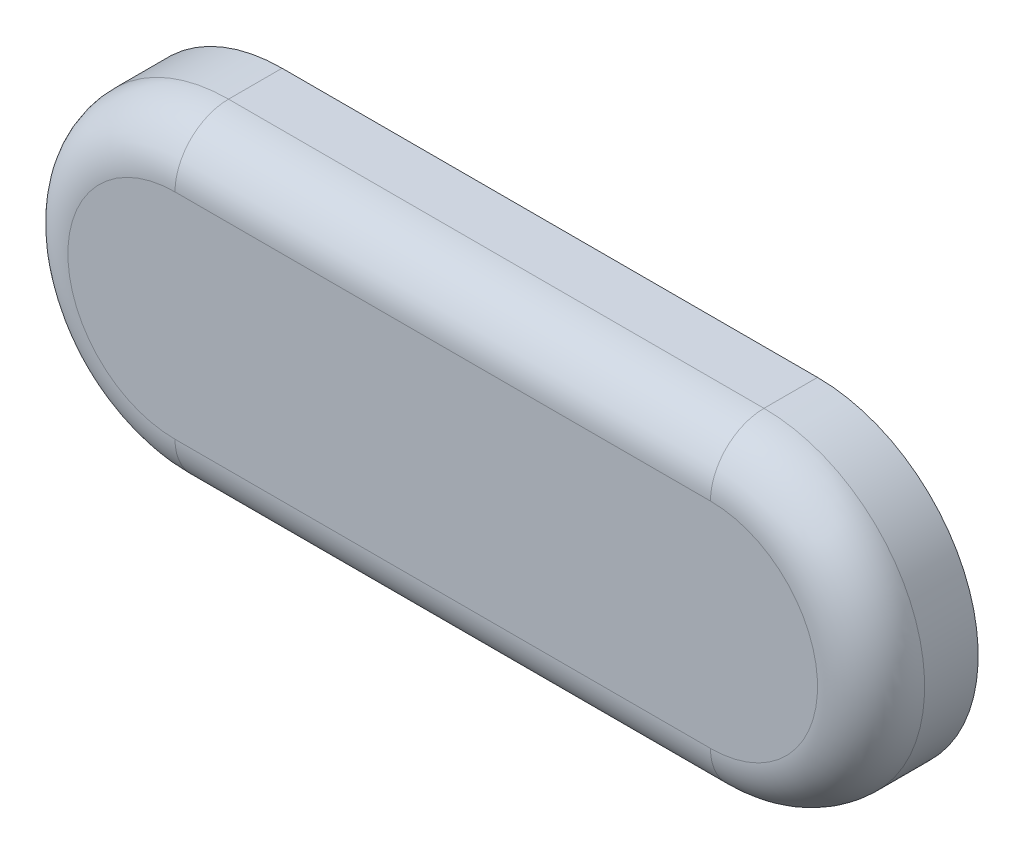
ISO-10303-21;
HEADER;
FILE_DESCRIPTION(('STEP AP214'),'2;1');
FILE_NAME('part.step','',(''),(''),'','','');
FILE_SCHEMA(('AUTOMOTIVE_DESIGN { 1 0 10303 214 1 1 1 1 }'));
ENDSEC;
DATA;
#1=APPLICATION_CONTEXT('core data for automotive mechanical design processes');
#2=APPLICATION_PROTOCOL_DEFINITION('international standard','automotive_design',2000,#1);
#3=PRODUCT_CONTEXT('',#1,'mechanical');
#4=PRODUCT('Part','Part','',(#3));
#5=PRODUCT_RELATED_PRODUCT_CATEGORY('part','',(#4));
#6=PRODUCT_DEFINITION_FORMATION('','',#4);
#7=PRODUCT_DEFINITION_CONTEXT('part definition',#1,'design');
#8=PRODUCT_DEFINITION('design','',#6,#7);
#9=PRODUCT_DEFINITION_SHAPE('','',#8);
#10=(LENGTH_UNIT() NAMED_UNIT(*) SI_UNIT(.MILLI.,.METRE.));
#11=(NAMED_UNIT(*) PLANE_ANGLE_UNIT() SI_UNIT($,.RADIAN.));
#12=(NAMED_UNIT(*) SI_UNIT($,.STERADIAN.) SOLID_ANGLE_UNIT());
#13=UNCERTAINTY_MEASURE_WITH_UNIT(LENGTH_MEASURE(1.E-05),#10,'distance_accuracy_value','');
#14=(GEOMETRIC_REPRESENTATION_CONTEXT(3) GLOBAL_UNCERTAINTY_ASSIGNED_CONTEXT((#13)) GLOBAL_UNIT_ASSIGNED_CONTEXT((#10,
#11,#12)) REPRESENTATION_CONTEXT('',''));
#15=CARTESIAN_POINT('',(0.,0.,0.));
#16=DIRECTION('',(0.,0.,1.));
#17=DIRECTION('',(1.,0.,0.));
#18=AXIS2_PLACEMENT_3D('',#15,#16,#17);
#19=CARTESIAN_POINT('',(-5.,-23.375,2.));
#20=DIRECTION('',(0.,0.,-1.));
#21=DIRECTION('',(-1.,0.,0.));
#22=AXIS2_PLACEMENT_3D('',#19,#20,#21);
#23=CYLINDRICAL_SURFACE('',#22,3.);
#24=DIRECTION('',(0.,0.,-1.));
#25=VECTOR('',#24,1.);
#26=CARTESIAN_POINT('',(-5.,-26.375,2.));
#27=LINE('',#26,#25);
#28=CARTESIAN_POINT('',(-5.,-26.375,1.));
#29=VERTEX_POINT('',#28);
#30=CARTESIAN_POINT('',(-5.,-26.375,0.));
#31=VERTEX_POINT('',#30);
#32=EDGE_CURVE('E91',#29,#31,#27,.T.);
#33=ORIENTED_EDGE('',*,*,#32,.F.);
#34=CARTESIAN_POINT('',(-5.,-23.375,1.));
#35=DIRECTION('',(0.,0.,1.));
#36=DIRECTION('',(1.,0.,0.));
#37=AXIS2_PLACEMENT_3D('',#34,#35,#36);
#38=CIRCLE('',#37,3.);
#39=CARTESIAN_POINT('',(-5.,-20.375,1.));
#40=VERTEX_POINT('',#39);
#41=EDGE_CURVE('E61',#29,#40,#38,.F.);
#42=ORIENTED_EDGE('',*,*,#41,.T.);
#43=DIRECTION('',(0.,0.,-1.));
#44=VECTOR('',#43,1.);
#45=CARTESIAN_POINT('',(-5.,-20.375,2.));
#46=LINE('',#45,#44);
#47=CARTESIAN_POINT('',(-5.,-20.375,0.));
#48=VERTEX_POINT('',#47);
#49=EDGE_CURVE('E111',#40,#48,#46,.T.);
#50=ORIENTED_EDGE('',*,*,#49,.T.);
#51=CARTESIAN_POINT('',(-5.,-23.375,0.));
#52=DIRECTION('',(0.,0.,1.));
#53=DIRECTION('',(1.,0.,0.));
#54=AXIS2_PLACEMENT_3D('',#51,#52,#53);
#55=CIRCLE('',#54,3.);
#56=EDGE_CURVE('E107',#48,#31,#55,.T.);
#57=ORIENTED_EDGE('',*,*,#56,.T.);
#58=EDGE_LOOP('',(#33,#42,#50,#57));
#59=FACE_BOUND('',#58,.T.);
#60=ADVANCED_FACE('F37',(#59),#23,.T.);
#61=CARTESIAN_POINT('',(-5.,-26.375,2.));
#62=DIRECTION('',(0.,1.,0.));
#63=DIRECTION('',(0.,0.,1.));
#64=AXIS2_PLACEMENT_3D('',#61,#62,#63);
#65=PLANE('',#64);
#66=DIRECTION('',(0.,0.,-1.));
#67=VECTOR('',#66,1.);
#68=CARTESIAN_POINT('',(5.,-26.375,2.));
#69=LINE('',#68,#67);
#70=CARTESIAN_POINT('',(5.,-26.375,1.));
#71=VERTEX_POINT('',#70);
#72=CARTESIAN_POINT('',(5.,-26.375,0.));
#73=VERTEX_POINT('',#72);
#74=EDGE_CURVE('E101',#71,#73,#69,.T.);
#75=ORIENTED_EDGE('',*,*,#74,.F.);
#76=DIRECTION('',(1.,0.,0.));
#77=VECTOR('',#76,1.);
#78=CARTESIAN_POINT('',(-5.,-26.375,1.));
#79=LINE('',#78,#77);
#80=EDGE_CURVE('E98',#71,#29,#79,.F.);
#81=ORIENTED_EDGE('',*,*,#80,.T.);
#82=ORIENTED_EDGE('',*,*,#32,.T.);
#83=DIRECTION('',(1.,0.,0.));
#84=VECTOR('',#83,1.);
#85=CARTESIAN_POINT('',(-5.,-26.375,0.));
#86=LINE('',#85,#84);
#87=EDGE_CURVE('E95',#31,#73,#86,.T.);
#88=ORIENTED_EDGE('',*,*,#87,.T.);
#89=EDGE_LOOP('',(#75,#81,#82,#88));
#90=FACE_BOUND('',#89,.T.);
#91=ADVANCED_FACE('F94',(#90),#65,.F.);
#92=CARTESIAN_POINT('',(5.,-23.375,2.));
#93=DIRECTION('',(0.,0.,-1.));
#94=DIRECTION('',(-1.,0.,0.));
#95=AXIS2_PLACEMENT_3D('',#92,#93,#94);
#96=CYLINDRICAL_SURFACE('',#95,3.);
#97=DIRECTION('',(0.,0.,-1.));
#98=VECTOR('',#97,1.);
#99=CARTESIAN_POINT('',(5.,-20.375,2.));
#100=LINE('',#99,#98);
#101=CARTESIAN_POINT('',(5.,-20.375,1.));
#102=VERTEX_POINT('',#101);
#103=CARTESIAN_POINT('',(5.,-20.375,0.));
#104=VERTEX_POINT('',#103);
#105=EDGE_CURVE('E121',#102,#104,#100,.T.);
#106=ORIENTED_EDGE('',*,*,#105,.F.);
#107=CARTESIAN_POINT('',(5.,-23.375,1.));
#108=DIRECTION('',(0.,0.,1.));
#109=DIRECTION('',(1.,0.,0.));
#110=AXIS2_PLACEMENT_3D('',#107,#108,#109);
#111=CIRCLE('',#110,3.);
#112=EDGE_CURVE('E11',#102,#71,#111,.F.);
#113=ORIENTED_EDGE('',*,*,#112,.T.);
#114=ORIENTED_EDGE('',*,*,#74,.T.);
#115=CARTESIAN_POINT('',(5.,-23.375,0.));
#116=DIRECTION('',(0.,0.,1.));
#117=DIRECTION('',(1.,0.,0.));
#118=AXIS2_PLACEMENT_3D('',#115,#116,#117);
#119=CIRCLE('',#118,3.);
#120=EDGE_CURVE('E109',#73,#104,#119,.T.);
#121=ORIENTED_EDGE('',*,*,#120,.T.);
#122=EDGE_LOOP('',(#106,#113,#114,#121));
#123=FACE_BOUND('',#122,.T.);
#124=ADVANCED_FACE('F168',(#123),#96,.T.);
#125=CARTESIAN_POINT('',(5.,-20.375,2.));
#126=DIRECTION('',(0.,-1.,0.));
#127=DIRECTION('',(0.,0.,-1.));
#128=AXIS2_PLACEMENT_3D('',#125,#126,#127);
#129=PLANE('',#128);
#130=ORIENTED_EDGE('',*,*,#49,.F.);
#131=DIRECTION('',(-1.,0.,0.));
#132=VECTOR('',#131,1.);
#133=CARTESIAN_POINT('',(5.,-20.375,1.));
#134=LINE('',#133,#132);
#135=EDGE_CURVE('E46',#40,#102,#134,.F.);
#136=ORIENTED_EDGE('',*,*,#135,.T.);
#137=ORIENTED_EDGE('',*,*,#105,.T.);
#138=DIRECTION('',(-1.,0.,0.));
#139=VECTOR('',#138,1.);
#140=CARTESIAN_POINT('',(5.,-20.375,0.));
#141=LINE('',#140,#139);
#142=EDGE_CURVE('E118',#104,#48,#141,.T.);
#143=ORIENTED_EDGE('',*,*,#142,.T.);
#144=EDGE_LOOP('',(#130,#136,#137,#143));
#145=FACE_BOUND('',#144,.T.);
#146=ADVANCED_FACE('F203',(#145),#129,.F.);
#147=CARTESIAN_POINT('',(-5.,-23.375,2.));
#148=DIRECTION('',(0.,0.,1.));
#149=DIRECTION('',(1.,0.,0.));
#150=AXIS2_PLACEMENT_3D('',#147,#148,#149);
#151=PLANE('',#150);
#152=CARTESIAN_POINT('',(-5.,-23.375,2.));
#153=DIRECTION('',(0.,0.,1.));
#154=DIRECTION('',(1.,0.,0.));
#155=AXIS2_PLACEMENT_3D('',#152,#153,#154);
#156=CIRCLE('',#155,2.);
#157=CARTESIAN_POINT('',(-5.,-21.375,2.));
#158=VERTEX_POINT('',#157);
#159=CARTESIAN_POINT('',(-5.,-25.375,2.));
#160=VERTEX_POINT('',#159);
#161=EDGE_CURVE('E127',#158,#160,#156,.T.);
#162=ORIENTED_EDGE('',*,*,#161,.T.);
#163=DIRECTION('',(1.,0.,0.));
#164=VECTOR('',#163,1.);
#165=CARTESIAN_POINT('',(5.,-25.375,2.));
#166=LINE('',#165,#164);
#167=CARTESIAN_POINT('',(5.,-25.375,2.));
#168=VERTEX_POINT('',#167);
#169=EDGE_CURVE('E129',#160,#168,#166,.T.);
#170=ORIENTED_EDGE('',*,*,#169,.T.);
#171=CARTESIAN_POINT('',(5.,-23.375,2.));
#172=DIRECTION('',(0.,0.,1.));
#173=DIRECTION('',(1.,0.,0.));
#174=AXIS2_PLACEMENT_3D('',#171,#172,#173);
#175=CIRCLE('',#174,2.);
#176=CARTESIAN_POINT('',(5.,-21.375,2.));
#177=VERTEX_POINT('',#176);
#178=EDGE_CURVE('E100',#168,#177,#175,.T.);
#179=ORIENTED_EDGE('',*,*,#178,.T.);
#180=DIRECTION('',(-1.,0.,0.));
#181=VECTOR('',#180,1.);
#182=CARTESIAN_POINT('',(-5.,-21.375,2.));
#183=LINE('',#182,#181);
#184=EDGE_CURVE('E125',#177,#158,#183,.T.);
#185=ORIENTED_EDGE('',*,*,#184,.T.);
#186=EDGE_LOOP('',(#162,#170,#179,#185));
#187=FACE_BOUND('',#186,.T.);
#188=ADVANCED_FACE('F150',(#187),#151,.T.);
#189=CARTESIAN_POINT('',(-5.,-23.375,0.));
#190=DIRECTION('',(0.,0.,1.));
#191=DIRECTION('',(1.,0.,0.));
#192=AXIS2_PLACEMENT_3D('',#189,#190,#191);
#193=PLANE('',#192);
#194=ORIENTED_EDGE('',*,*,#56,.F.);
#195=ORIENTED_EDGE('',*,*,#142,.F.);
#196=ORIENTED_EDGE('',*,*,#120,.F.);
#197=ORIENTED_EDGE('',*,*,#87,.F.);
#198=EDGE_LOOP('',(#194,#195,#196,#197));
#199=FACE_BOUND('',#198,.T.);
#200=ADVANCED_FACE('F105',(#199),#193,.F.);
#201=CARTESIAN_POINT('',(-5.,-21.375,1.));
#202=DIRECTION('',(1.,0.,0.));
#203=DIRECTION('',(0.,0.,-1.));
#204=AXIS2_PLACEMENT_3D('',#201,#202,#203);
#205=CYLINDRICAL_SURFACE('',#204,1.);
#206=CARTESIAN_POINT('',(5.,-21.375,1.));
#207=DIRECTION('',(1.,0.,0.));
#208=DIRECTION('',(0.,0.,-1.));
#209=AXIS2_PLACEMENT_3D('',#206,#207,#208);
#210=CIRCLE('',#209,1.);
#211=EDGE_CURVE('E115',#102,#177,#210,.T.);
#212=ORIENTED_EDGE('',*,*,#211,.F.);
#213=ORIENTED_EDGE('',*,*,#135,.F.);
#214=CARTESIAN_POINT('',(-5.,-21.375,1.));
#215=DIRECTION('',(-1.,0.,0.));
#216=DIRECTION('',(0.,0.,1.));
#217=AXIS2_PLACEMENT_3D('',#214,#215,#216);
#218=CIRCLE('',#217,1.);
#219=EDGE_CURVE('E41',#158,#40,#218,.T.);
#220=ORIENTED_EDGE('',*,*,#219,.F.);
#221=ORIENTED_EDGE('',*,*,#184,.F.);
#222=EDGE_LOOP('',(#212,#213,#220,#221));
#223=FACE_BOUND('',#222,.T.);
#224=ADVANCED_FACE('F39',(#223),#205,.T.);
#225=CARTESIAN_POINT('',(-5.,-23.375,1.));
#226=DIRECTION('',(0.,0.,1.));
#227=DIRECTION('',(1.,0.,0.));
#228=AXIS2_PLACEMENT_3D('',#225,#226,#227);
#229=TOROIDAL_SURFACE('',#228,2.,1.);
#230=ORIENTED_EDGE('',*,*,#219,.T.);
#231=ORIENTED_EDGE('',*,*,#41,.F.);
#232=CARTESIAN_POINT('',(-5.,-25.375,1.));
#233=DIRECTION('',(1.,0.,0.));
#234=DIRECTION('',(0.,0.,-1.));
#235=AXIS2_PLACEMENT_3D('',#232,#233,#234);
#236=CIRCLE('',#235,1.);
#237=EDGE_CURVE('E137',#160,#29,#236,.T.);
#238=ORIENTED_EDGE('',*,*,#237,.F.);
#239=ORIENTED_EDGE('',*,*,#161,.F.);
#240=EDGE_LOOP('',(#230,#231,#238,#239));
#241=FACE_BOUND('',#240,.T.);
#242=ADVANCED_FACE('F156',(#241),#229,.T.);
#243=CARTESIAN_POINT('',(5.,-23.375,1.));
#244=DIRECTION('',(0.,0.,1.));
#245=DIRECTION('',(1.,0.,0.));
#246=AXIS2_PLACEMENT_3D('',#243,#244,#245);
#247=TOROIDAL_SURFACE('',#246,2.,1.);
#248=ORIENTED_EDGE('',*,*,#211,.T.);
#249=ORIENTED_EDGE('',*,*,#178,.F.);
#250=CARTESIAN_POINT('',(5.,-25.375,1.));
#251=DIRECTION('',(-1.,0.,0.));
#252=DIRECTION('',(0.,0.,1.));
#253=AXIS2_PLACEMENT_3D('',#250,#251,#252);
#254=CIRCLE('',#253,1.);
#255=EDGE_CURVE('E135',#71,#168,#254,.T.);
#256=ORIENTED_EDGE('',*,*,#255,.F.);
#257=ORIENTED_EDGE('',*,*,#112,.F.);
#258=EDGE_LOOP('',(#248,#249,#256,#257));
#259=FACE_BOUND('',#258,.T.);
#260=ADVANCED_FACE('F143',(#259),#247,.T.);
#261=CARTESIAN_POINT('',(-5.,-25.375,1.));
#262=DIRECTION('',(-1.,0.,0.));
#263=DIRECTION('',(0.,0.,1.));
#264=AXIS2_PLACEMENT_3D('',#261,#262,#263);
#265=CYLINDRICAL_SURFACE('',#264,1.);
#266=ORIENTED_EDGE('',*,*,#237,.T.);
#267=ORIENTED_EDGE('',*,*,#80,.F.);
#268=ORIENTED_EDGE('',*,*,#255,.T.);
#269=ORIENTED_EDGE('',*,*,#169,.F.);
#270=EDGE_LOOP('',(#266,#267,#268,#269));
#271=FACE_BOUND('',#270,.T.);
#272=ADVANCED_FACE('F154',(#271),#265,.T.);
#273=CLOSED_SHELL('',(#60,#91,#124,#146,#188,#200,#224,#242,#260,#272));
#274=MANIFOLD_SOLID_BREP('B2',#273);
#275=ADVANCED_BREP_SHAPE_REPRESENTATION('',(#18,#274),#14);
#276=SHAPE_DEFINITION_REPRESENTATION(#9,#275);
ENDSEC;
END-ISO-10303-21;
